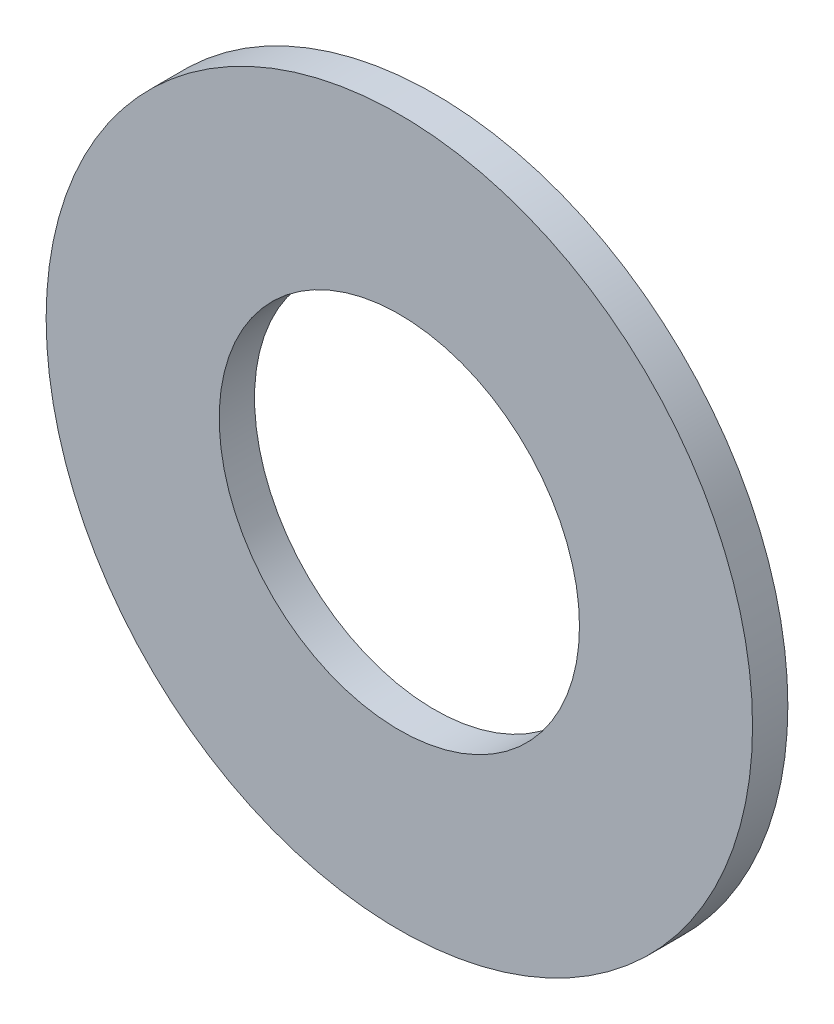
ISO-10303-21;
HEADER;
FILE_DESCRIPTION(('STEP AP214'),'2;1');
FILE_NAME('part.step','',(''),(''),'','','');
FILE_SCHEMA(('AUTOMOTIVE_DESIGN { 1 0 10303 214 1 1 1 1 }'));
ENDSEC;
DATA;
#1=APPLICATION_CONTEXT('core data for automotive mechanical design processes');
#2=APPLICATION_PROTOCOL_DEFINITION('international standard','automotive_design',2000,#1);
#3=PRODUCT_CONTEXT('',#1,'mechanical');
#4=PRODUCT('Part','Part','',(#3));
#5=PRODUCT_RELATED_PRODUCT_CATEGORY('part','',(#4));
#6=PRODUCT_DEFINITION_FORMATION('','',#4);
#7=PRODUCT_DEFINITION_CONTEXT('part definition',#1,'design');
#8=PRODUCT_DEFINITION('design','',#6,#7);
#9=PRODUCT_DEFINITION_SHAPE('','',#8);
#10=(LENGTH_UNIT() NAMED_UNIT(*) SI_UNIT(.MILLI.,.METRE.));
#11=(NAMED_UNIT(*) PLANE_ANGLE_UNIT() SI_UNIT($,.RADIAN.));
#12=(NAMED_UNIT(*) SI_UNIT($,.STERADIAN.) SOLID_ANGLE_UNIT());
#13=UNCERTAINTY_MEASURE_WITH_UNIT(LENGTH_MEASURE(1.E-05),#10,'distance_accuracy_value','');
#14=(GEOMETRIC_REPRESENTATION_CONTEXT(3) GLOBAL_UNCERTAINTY_ASSIGNED_CONTEXT((#13)) GLOBAL_UNIT_ASSIGNED_CONTEXT((#10,
#11,#12)) REPRESENTATION_CONTEXT('',''));
#15=CARTESIAN_POINT('',(0.,0.,0.));
#16=DIRECTION('',(0.,0.,1.));
#17=DIRECTION('',(1.,0.,0.));
#18=AXIS2_PLACEMENT_3D('',#15,#16,#17);
#19=CARTESIAN_POINT('',(0.,0.,0.999999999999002));
#20=DIRECTION('',(0.,0.,1.));
#21=DIRECTION('',(1.,0.,0.));
#22=AXIS2_PLACEMENT_3D('',#19,#20,#21);
#23=PLANE('',#22);
#24=CARTESIAN_POINT('',(0.,0.,0.999999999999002));
#25=DIRECTION('',(0.,0.,1.));
#26=DIRECTION('',(1.,0.,0.));
#27=AXIS2_PLACEMENT_3D('',#24,#25,#26);
#28=CIRCLE('',#27,10.);
#29=CARTESIAN_POINT('',(10.,0.,0.999999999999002));
#30=VERTEX_POINT('',#29);
#31=EDGE_CURVE('E10',#30,#30,#28,.T.);
#32=ORIENTED_EDGE('',*,*,#31,.T.);
#33=EDGE_LOOP('',(#32));
#34=FACE_BOUND('',#33,.T.);
#35=CARTESIAN_POINT('',(0.,0.,0.999999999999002));
#36=DIRECTION('',(0.,0.,1.));
#37=DIRECTION('',(1.,0.,0.));
#38=AXIS2_PLACEMENT_3D('',#35,#36,#37);
#39=CIRCLE('',#38,5.1);
#40=CARTESIAN_POINT('',(5.1,0.,0.999999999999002));
#41=VERTEX_POINT('',#40);
#42=EDGE_CURVE('E44',#41,#41,#39,.T.);
#43=ORIENTED_EDGE('',*,*,#42,.F.);
#44=EDGE_LOOP('',(#43));
#45=FACE_BOUND('',#44,.T.);
#46=ADVANCED_FACE('F32',(#34,#45),#23,.T.);
#47=CARTESIAN_POINT('',(3.33066907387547E-13,0.,-8.88178419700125E-13));
#48=DIRECTION('',(0.,0.,1.));
#49=DIRECTION('',(1.,0.,0.));
#50=AXIS2_PLACEMENT_3D('',#47,#48,#49);
#51=PLANE('',#50);
#52=CARTESIAN_POINT('',(3.33066907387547E-13,0.,-8.88178419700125E-13));
#53=DIRECTION('',(0.,0.,1.));
#54=DIRECTION('',(1.,0.,0.));
#55=AXIS2_PLACEMENT_3D('',#52,#53,#54);
#56=CIRCLE('',#55,10.);
#57=CARTESIAN_POINT('',(10.0000000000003,0.,-8.87623308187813E-13));
#58=VERTEX_POINT('',#57);
#59=EDGE_CURVE('E39',#58,#58,#56,.T.);
#60=ORIENTED_EDGE('',*,*,#59,.F.);
#61=EDGE_LOOP('',(#60));
#62=FACE_BOUND('',#61,.T.);
#63=CARTESIAN_POINT('',(3.33066907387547E-13,0.,-8.88178419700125E-13));
#64=DIRECTION('',(0.,0.,1.));
#65=DIRECTION('',(1.,0.,0.));
#66=AXIS2_PLACEMENT_3D('',#63,#64,#65);
#67=CIRCLE('',#66,5.1);
#68=CARTESIAN_POINT('',(5.10000000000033,0.,-8.87895312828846E-13));
#69=VERTEX_POINT('',#68);
#70=EDGE_CURVE('E50',#69,#69,#67,.T.);
#71=ORIENTED_EDGE('',*,*,#70,.T.);
#72=EDGE_LOOP('',(#71));
#73=FACE_BOUND('',#72,.T.);
#74=ADVANCED_FACE('F56',(#62,#73),#51,.F.);
#75=CARTESIAN_POINT('',(0.,0.,0.999999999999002));
#76=DIRECTION('',(0.,0.,-1.));
#77=DIRECTION('',(-1.,0.,0.));
#78=AXIS2_PLACEMENT_3D('',#75,#76,#77);
#79=CYLINDRICAL_SURFACE('',#78,10.);
#80=ORIENTED_EDGE('',*,*,#31,.F.);
#81=EDGE_LOOP('',(#80));
#82=FACE_BOUND('',#81,.T.);
#83=ORIENTED_EDGE('',*,*,#59,.T.);
#84=EDGE_LOOP('',(#83));
#85=FACE_BOUND('',#84,.T.);
#86=ADVANCED_FACE('F34',(#82,#85),#79,.T.);
#87=CARTESIAN_POINT('',(0.,0.,0.999999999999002));
#88=DIRECTION('',(0.,0.,-1.));
#89=DIRECTION('',(-1.,0.,0.));
#90=AXIS2_PLACEMENT_3D('',#87,#88,#89);
#91=CYLINDRICAL_SURFACE('',#90,5.1);
#92=ORIENTED_EDGE('',*,*,#42,.T.);
#93=EDGE_LOOP('',(#92));
#94=FACE_BOUND('',#93,.T.);
#95=ORIENTED_EDGE('',*,*,#70,.F.);
#96=EDGE_LOOP('',(#95));
#97=FACE_BOUND('',#96,.T.);
#98=ADVANCED_FACE('F58',(#94,#97),#91,.F.);
#99=CLOSED_SHELL('',(#46,#74,#86,#98));
#100=MANIFOLD_SOLID_BREP('B2',#99);
#101=ADVANCED_BREP_SHAPE_REPRESENTATION('',(#18,#100),#14);
#102=SHAPE_DEFINITION_REPRESENTATION(#9,#101);
ENDSEC;
END-ISO-10303-21;
